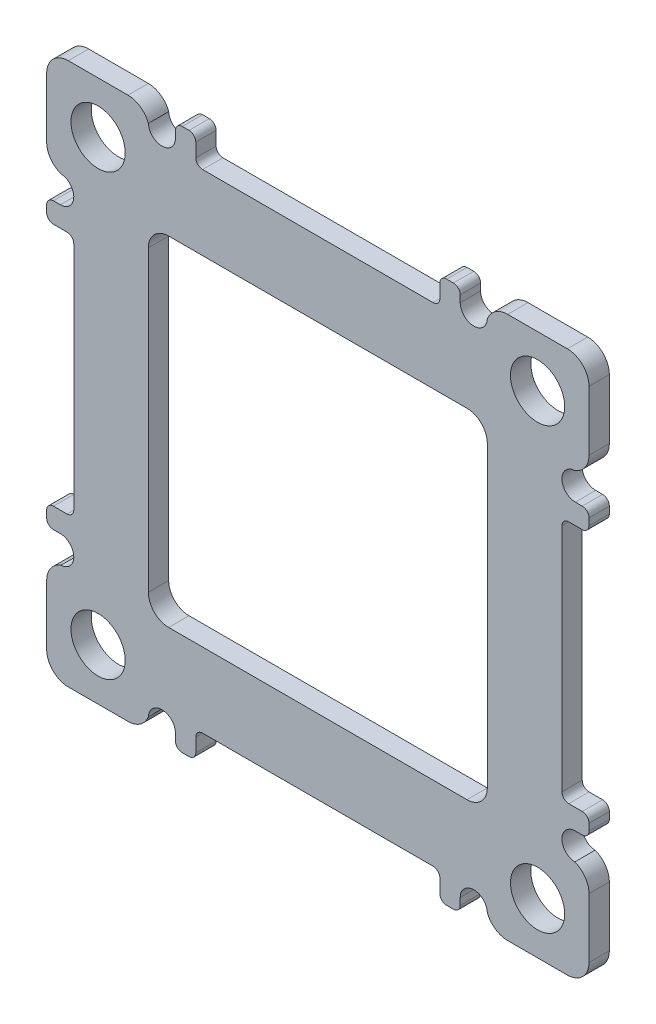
from build123d import *

# Parameters (mm, degrees)
BOSS_EXTRUDE1_DEPTH = 3
SKETCH2_R           = 4
CUT_EXTRUDE1_DEPTH  = 3


with BuildPart() as part:
    # Sketch1 → Boss-Extrude1 (new body)
    with BuildSketch(Plane.XY):
        with BuildLine():
            Line((-28.0025846, 40), (-36.803856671, 40))
            ThreePointArc((-36.803856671, 40), (-39.063871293, 39.063871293), (-40, 36.803856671))
            Line((-40, 36.803856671), (-40, 28.0025846))
            ThreePointArc((-40, 28.0025846), (-39.422660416, 26.170318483), (-37.899218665, 25))
            ThreePointArc((-37.899218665, 25), (-36.000457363, 22.95977119), (-37.984721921, 21.002599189))
            ThreePointArc((-37.984721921, 21.002599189), (-37.986631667, 21.002588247), (-37.988541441, 21.0025846))
            Line((-37.988541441, 21.0025846), (-39, 21.0025846))
            ThreePointArc((-39, 21.0025846), (-39.707106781, 20.709691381), (-40, 20.0025846))
            Line((-40, 20.0025846), (-40, 19.0025846))
            ThreePointArc((-40, 19.0025846), (-39.707106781, 18.295477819), (-39, 18.0025846))
            Line((-39, 18.0025846), (-37, 18.0025846))
            ThreePointArc((-37, 18.0025846), (-36.292893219, 17.709691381), (-36, 17.0025846))
            Line((-36, 17.0025846), (-36, -17.0025846))
            ThreePointArc((-36, -17.0025846), (-36.292893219, -17.709691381), (-37, -18.0025846))
            Line((-37, -18.0025846), (-39, -18.0025846))
            ThreePointArc((-39, -18.0025846), (-39.707106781, -18.295477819), (-40, -19.0025846))
            Line((-40, -19.0025846), (-40, -20.0025846))
            ThreePointArc((-40, -20.0025846), (-39.707106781, -20.709691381), (-39, -21.0025846))
            Line((-39, -21.0025846), (-37.988541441, -21.0025846))
            ThreePointArc((-37.988541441, -21.0025846), (-37.986631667, -21.002588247), (-37.984721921, -21.002599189))
            ThreePointArc((-37.984721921, -21.002599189), (-36.000457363, -22.95977119), (-37.899218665, -25))
            ThreePointArc((-37.899218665, -25), (-39.422660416, -26.170318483), (-40, -28.0025846))
            Line((-40, -28.0025846), (-40, -36.803856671))
            ThreePointArc((-40, -36.803856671), (-39.063871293, -39.063871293), (-36.803856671, -40))
            Line((-36.803856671, -40), (-28.0025846, -40))
            ThreePointArc((-28.0025846, -40), (-26.170318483, -39.422660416), (-25, -37.899218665))
            ThreePointArc((-25, -37.899218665), (-22.95977119, -36.000457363), (-21.002599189, -37.984721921))
            ThreePointArc((-21.002599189, -37.984721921), (-21.002588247, -37.986631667), (-21.0025846, -37.988541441))
            Line((-21.0025846, -37.988541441), (-21.0025846, -39))
            ThreePointArc((-21.0025846, -39), (-20.709691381, -39.707106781), (-20.0025846, -40))
            Line((-20.0025846, -40), (-19.0025846, -40))
            ThreePointArc((-19.0025846, -40), (-18.295477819, -39.707106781), (-18.0025846, -39))
            Line((-18.0025846, -39), (-18.0025846, -37))
            ThreePointArc((-18.0025846, -37), (-17.709691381, -36.292893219), (-17.0025846, -36))
            Line((-17.0025846, -36), (17.0025846, -36))
            ThreePointArc((17.0025846, -36), (17.709691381, -36.292893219), (18.0025846, -37))
            Line((18.0025846, -37), (18.0025846, -39))
            ThreePointArc((18.0025846, -39), (18.295477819, -39.707106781), (19.0025846, -40))
            Line((19.0025846, -40), (20.0025846, -40))
            ThreePointArc((20.0025846, -40), (20.709691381, -39.707106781), (21.0025846, -39))
            Line((21.0025846, -39), (21.0025846, -37.988541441))
            ThreePointArc((21.0025846, -37.988541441), (21.002588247, -37.986631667), (21.002599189, -37.984721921))
            ThreePointArc((21.002599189, -37.984721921), (22.95977119, -36.000457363), (25, -37.899218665))
            ThreePointArc((25, -37.899218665), (26.170318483, -39.422660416), (28.0025846, -40))
            Line((28.0025846, -40), (36.803856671, -40))
            ThreePointArc((36.803856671, -40), (39.063871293, -39.063871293), (40, -36.803856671))
            Line((40, -36.803856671), (40, -28.0025846))
            ThreePointArc((40, -28.0025846), (39.422660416, -26.170318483), (37.899218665, -25))
            ThreePointArc((37.899218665, -25), (36.000457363, -22.95977119), (37.984721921, -21.002599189))
            ThreePointArc((37.984721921, -21.002599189), (37.986631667, -21.002588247), (37.988541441, -21.0025846))
            Line((37.988541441, -21.0025846), (39, -21.0025846))
            ThreePointArc((39, -21.0025846), (39.707106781, -20.709691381), (40, -20.0025846))
            Line((40, -20.0025846), (40, -19.0025846))
            ThreePointArc((40, -19.0025846), (39.707106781, -18.295477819), (39, -18.0025846))
            Line((39, -18.0025846), (37, -18.0025846))
            ThreePointArc((37, -18.0025846), (36.292893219, -17.709691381), (36, -17.0025846))
            Line((36, -17.0025846), (36, 17.0025846))
            ThreePointArc((36, 17.0025846), (36.292893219, 17.709691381), (37, 18.0025846))
            Line((37, 18.0025846), (39, 18.0025846))
            ThreePointArc((39, 18.0025846), (39.707106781, 18.295477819), (40, 19.0025846))
            Line((40, 19.0025846), (40, 20.0025846))
            ThreePointArc((40, 20.0025846), (39.707106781, 20.709691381), (39, 21.0025846))
            Line((39, 21.0025846), (37.988541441, 21.0025846))
            ThreePointArc((37.988541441, 21.0025846), (37.986631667, 21.002588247), (37.984721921, 21.002599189))
            ThreePointArc((37.984721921, 21.002599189), (36.000457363, 22.95977119), (37.899218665, 25))
            ThreePointArc((37.899218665, 25), (39.422660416, 26.170318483), (40, 28.0025846))
            Line((40, 28.0025846), (40, 36.803856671))
            ThreePointArc((40, 36.803856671), (39.063871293, 39.063871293), (36.803856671, 40))
            Line((36.803856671, 40), (28.0025846, 40))
            ThreePointArc((28.0025846, 40), (26.170318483, 39.422660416), (25, 37.899218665))
            ThreePointArc((25, 37.899218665), (22.95977119, 36.000457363), (21.002599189, 37.984721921))
            ThreePointArc((21.002599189, 37.984721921), (21.002588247, 37.986631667), (21.0025846, 37.988541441))
            Line((21.0025846, 37.988541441), (21.0025846, 39))
            ThreePointArc((21.0025846, 39), (20.709691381, 39.707106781), (20.0025846, 40))
            Line((20.0025846, 40), (19.0025846, 40))
            ThreePointArc((19.0025846, 40), (18.295477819, 39.707106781), (18.0025846, 39))
            Line((18.0025846, 39), (18.0025846, 37))
            ThreePointArc((18.0025846, 37), (17.709691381, 36.292893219), (17.0025846, 36))
            Line((17.0025846, 36), (-17.0025846, 36))
            ThreePointArc((-17.0025846, 36), (-17.709691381, 36.292893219), (-18.0025846, 37))
            Line((-18.0025846, 37), (-18.0025846, 39))
            ThreePointArc((-18.0025846, 39), (-18.295477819, 39.707106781), (-19.0025846, 40))
            Line((-19.0025846, 40), (-20.0025846, 40))
            ThreePointArc((-20.0025846, 40), (-20.709691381, 39.707106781), (-21.0025846, 39))
            Line((-21.0025846, 39), (-21.0025846, 37.988541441))
            ThreePointArc((-21.0025846, 37.988541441), (-21.002588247, 37.986631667), (-21.002599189, 37.984721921))
            ThreePointArc((-21.002599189, 37.984721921), (-22.95977119, 36.000457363), (-25, 37.899218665))
            ThreePointArc((-25, 37.899218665), (-26.170318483, 39.422660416), (-28.0025846, 40))
        make_face()
        with BuildLine():
            Line((-22, 25), (22, 25))
            ThreePointArc((22, 25), (24.121320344, 24.121320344), (25, 22))
            Line((25, 22), (25, -22))
            ThreePointArc((25, -22), (24.121320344, -24.121320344), (22, -25))
            Line((22, -25), (-22, -25))
            ThreePointArc((-22, -25), (-24.121320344, -24.121320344), (-25, -22))
            Line((-25, -22), (-25, 22))
            ThreePointArc((-25, 22), (-24.121320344, 24.121320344), (-22, 25))
        make_face(mode=Mode.SUBTRACT)
    extrude(amount=BOSS_EXTRUDE1_DEPTH)

    # Sketch2 → Cut-Extrude1 (cut)
    with BuildSketch(Plane.XY.offset(3)):
        with Locations((-32.414747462, 32.414747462)):
            Circle(SKETCH2_R)
        with Locations(Location((32.414747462, 32.414747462, 0), (0, 0, 180))):
            Circle(SKETCH2_R)
        with Locations(Location((-32.414747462, -32.414747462, 0), (0, 0, 180))):
            Circle(SKETCH2_R)
        with Locations((32.414747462, -32.414747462)):
            Circle(SKETCH2_R)
    extrude(amount=-CUT_EXTRUDE1_DEPTH, mode=Mode.SUBTRACT)


solid = part.part
